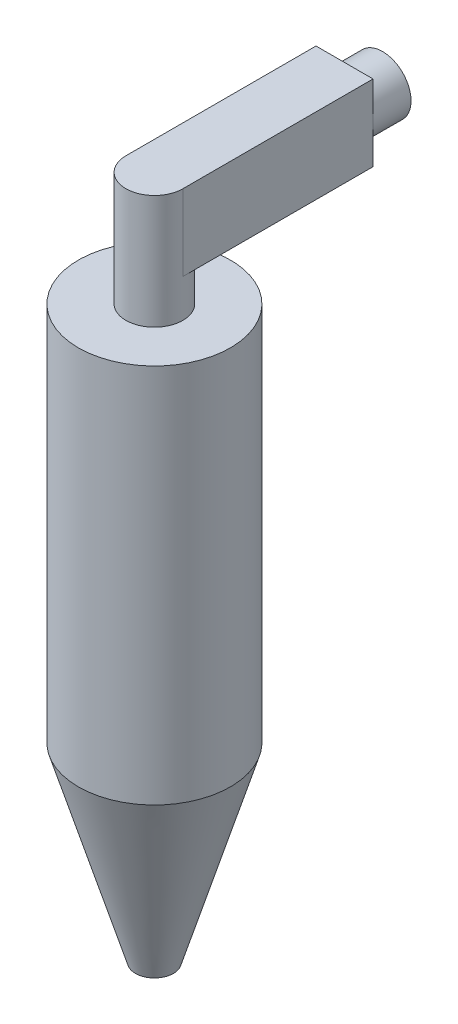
ISO-10303-21;
HEADER;
FILE_DESCRIPTION(('STEP AP214'),'2;1');
FILE_NAME('part.step','',(''),(''),'','','');
FILE_SCHEMA(('AUTOMOTIVE_DESIGN { 1 0 10303 214 1 1 1 1 }'));
ENDSEC;
DATA;
#1=APPLICATION_CONTEXT('core data for automotive mechanical design processes');
#2=APPLICATION_PROTOCOL_DEFINITION('international standard','automotive_design',2000,#1);
#3=PRODUCT_CONTEXT('',#1,'mechanical');
#4=PRODUCT('Part','Part','',(#3));
#5=PRODUCT_RELATED_PRODUCT_CATEGORY('part','',(#4));
#6=PRODUCT_DEFINITION_FORMATION('','',#4);
#7=PRODUCT_DEFINITION_CONTEXT('part definition',#1,'design');
#8=PRODUCT_DEFINITION('design','',#6,#7);
#9=PRODUCT_DEFINITION_SHAPE('','',#8);
#10=(LENGTH_UNIT() NAMED_UNIT(*) SI_UNIT(.MILLI.,.METRE.));
#11=(NAMED_UNIT(*) PLANE_ANGLE_UNIT() SI_UNIT($,.RADIAN.));
#12=(NAMED_UNIT(*) SI_UNIT($,.STERADIAN.) SOLID_ANGLE_UNIT());
#13=UNCERTAINTY_MEASURE_WITH_UNIT(LENGTH_MEASURE(1.E-05),#10,'distance_accuracy_value','');
#14=(GEOMETRIC_REPRESENTATION_CONTEXT(3) GLOBAL_UNCERTAINTY_ASSIGNED_CONTEXT((#13)) GLOBAL_UNIT_ASSIGNED_CONTEXT((#10,
#11,#12)) REPRESENTATION_CONTEXT('',''));
#15=CARTESIAN_POINT('',(0.,0.,0.));
#16=DIRECTION('',(0.,0.,1.));
#17=DIRECTION('',(1.,0.,0.));
#18=AXIS2_PLACEMENT_3D('',#15,#16,#17);
#19=CARTESIAN_POINT('',(0.,0.,-50.));
#20=DIRECTION('',(0.,0.,1.));
#21=DIRECTION('',(1.,0.,0.));
#22=AXIS2_PLACEMENT_3D('',#19,#20,#21);
#23=PLANE('',#22);
#24=CARTESIAN_POINT('',(0.,170.,-50.));
#25=DIRECTION('',(0.,0.,-1.));
#26=DIRECTION('',(-1.,0.,0.));
#27=AXIS2_PLACEMENT_3D('',#24,#25,#26);
#28=CIRCLE('',#27,7.5);
#29=CARTESIAN_POINT('',(-7.5,170.,-50.));
#30=VERTEX_POINT('',#29);
#31=CARTESIAN_POINT('',(7.5,170.,-50.));
#32=VERTEX_POINT('',#31);
#33=EDGE_CURVE('E48',#30,#32,#28,.T.);
#34=ORIENTED_EDGE('',*,*,#33,.F.);
#35=DIRECTION('',(0.,-1.,0.));
#36=VECTOR('',#35,1.);
#37=CARTESIAN_POINT('',(-7.5,180.,-50.));
#38=LINE('',#37,#36);
#39=CARTESIAN_POINT('',(-7.5,180.,-50.));
#40=VERTEX_POINT('',#39);
#41=EDGE_CURVE('E87',#40,#30,#38,.T.);
#42=ORIENTED_EDGE('',*,*,#41,.F.);
#43=DIRECTION('',(-1.,0.,0.));
#44=VECTOR('',#43,1.);
#45=CARTESIAN_POINT('',(-7.5,180.,-50.));
#46=LINE('',#45,#44);
#47=CARTESIAN_POINT('',(7.5,180.,-50.));
#48=VERTEX_POINT('',#47);
#49=EDGE_CURVE('E293',#48,#40,#46,.T.);
#50=ORIENTED_EDGE('',*,*,#49,.F.);
#51=DIRECTION('',(0.,1.,0.));
#52=VECTOR('',#51,1.);
#53=CARTESIAN_POINT('',(7.5,180.,-50.));
#54=LINE('',#53,#52);
#55=EDGE_CURVE('E105',#32,#48,#54,.T.);
#56=ORIENTED_EDGE('',*,*,#55,.F.);
#57=EDGE_LOOP('',(#34,#42,#50,#56));
#58=FACE_BOUND('',#57,.T.);
#59=ADVANCED_FACE('F37',(#58),#23,.F.);
#60=CARTESIAN_POINT('',(0.,0.,0.));
#61=DIRECTION('',(0.,1.,0.));
#62=DIRECTION('',(0.,0.,1.));
#63=AXIS2_PLACEMENT_3D('',#60,#61,#62);
#64=PLANE('',#63);
#65=CARTESIAN_POINT('',(0.,0.,0.));
#66=DIRECTION('',(0.,1.,0.));
#67=DIRECTION('',(0.,0.,1.));
#68=AXIS2_PLACEMENT_3D('',#65,#66,#67);
#69=CIRCLE('',#68,5.);
#70=CARTESIAN_POINT('',(0.,0.,5.));
#71=VERTEX_POINT('',#70);
#72=EDGE_CURVE('E168',#71,#71,#69,.T.);
#73=ORIENTED_EDGE('',*,*,#72,.F.);
#74=EDGE_LOOP('',(#73));
#75=FACE_BOUND('',#74,.T.);
#76=ADVANCED_FACE('F39',(#75),#64,.F.);
#77=CARTESIAN_POINT('',(0.,0.,0.));
#78=DIRECTION('',(0.,1.,0.));
#79=DIRECTION('',(0.,0.,1.));
#80=AXIS2_PLACEMENT_3D('',#77,#78,#79);
#81=CONICAL_SURFACE('',#80,5.,0.291456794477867);
#82=CARTESIAN_POINT('',(0.,50.,0.));
#83=DIRECTION('',(0.,1.,0.));
#84=DIRECTION('',(0.,0.,1.));
#85=AXIS2_PLACEMENT_3D('',#82,#83,#84);
#86=CIRCLE('',#85,20.);
#87=CARTESIAN_POINT('',(0.,50.,20.));
#88=VERTEX_POINT('',#87);
#89=EDGE_CURVE('E161',#88,#88,#86,.T.);
#90=CARTESIAN_POINT('',(0.,50.,20.));
#91=CARTESIAN_POINT('',(0.,49.4791666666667,19.84375));
#92=CARTESIAN_POINT('',(0.,48.9583333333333,19.6875));
#93=CARTESIAN_POINT('',(0.,47.9166666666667,19.375));
#94=CARTESIAN_POINT('',(0.,47.3958333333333,19.21875));
#95=CARTESIAN_POINT('',(0.,46.3541666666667,18.90625));
#96=CARTESIAN_POINT('',(0.,45.8333333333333,18.75));
#97=CARTESIAN_POINT('',(0.,44.7916666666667,18.4375));
#98=CARTESIAN_POINT('',(0.,44.2708333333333,18.28125));
#99=CARTESIAN_POINT('',(0.,43.2291666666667,17.96875));
#100=CARTESIAN_POINT('',(0.,42.7083333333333,17.8125));
#101=CARTESIAN_POINT('',(0.,41.6666666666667,17.5));
#102=CARTESIAN_POINT('',(0.,41.1458333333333,17.34375));
#103=CARTESIAN_POINT('',(0.,40.1041666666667,17.03125));
#104=CARTESIAN_POINT('',(0.,39.5833333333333,16.875));
#105=CARTESIAN_POINT('',(0.,38.5416666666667,16.5625));
#106=CARTESIAN_POINT('',(0.,38.0208333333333,16.40625));
#107=CARTESIAN_POINT('',(0.,36.9791666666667,16.09375));
#108=CARTESIAN_POINT('',(0.,36.4583333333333,15.9375));
#109=CARTESIAN_POINT('',(0.,35.4166666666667,15.625));
#110=CARTESIAN_POINT('',(0.,34.8958333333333,15.46875));
#111=CARTESIAN_POINT('',(0.,33.8541666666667,15.15625));
#112=CARTESIAN_POINT('',(0.,33.3333333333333,15.));
#113=CARTESIAN_POINT('',(0.,32.2916666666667,14.6875));
#114=CARTESIAN_POINT('',(0.,31.7708333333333,14.53125));
#115=CARTESIAN_POINT('',(0.,30.7291666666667,14.21875));
#116=CARTESIAN_POINT('',(0.,30.2083333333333,14.0625));
#117=CARTESIAN_POINT('',(0.,29.1666666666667,13.75));
#118=CARTESIAN_POINT('',(0.,28.6458333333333,13.59375));
#119=CARTESIAN_POINT('',(0.,27.6041666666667,13.28125));
#120=CARTESIAN_POINT('',(0.,27.0833333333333,13.125));
#121=CARTESIAN_POINT('',(0.,26.0416666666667,12.8125));
#122=CARTESIAN_POINT('',(0.,25.5208333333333,12.65625));
#123=CARTESIAN_POINT('',(0.,24.4791666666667,12.34375));
#124=CARTESIAN_POINT('',(0.,23.9583333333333,12.1875));
#125=CARTESIAN_POINT('',(0.,22.9166666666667,11.875));
#126=CARTESIAN_POINT('',(0.,22.3958333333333,11.71875));
#127=CARTESIAN_POINT('',(0.,21.3541666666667,11.40625));
#128=CARTESIAN_POINT('',(0.,20.8333333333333,11.25));
#129=CARTESIAN_POINT('',(0.,19.7916666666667,10.9375));
#130=CARTESIAN_POINT('',(0.,19.2708333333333,10.78125));
#131=CARTESIAN_POINT('',(0.,18.2291666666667,10.46875));
#132=CARTESIAN_POINT('',(0.,17.7083333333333,10.3125));
#133=CARTESIAN_POINT('',(0.,16.6666666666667,10.));
#134=CARTESIAN_POINT('',(0.,16.1458333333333,9.84375));
#135=CARTESIAN_POINT('',(0.,15.1041666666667,9.53125));
#136=CARTESIAN_POINT('',(0.,14.5833333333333,9.375));
#137=CARTESIAN_POINT('',(0.,13.5416666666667,9.0625));
#138=CARTESIAN_POINT('',(0.,13.0208333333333,8.90625));
#139=CARTESIAN_POINT('',(0.,11.9791666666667,8.59375));
#140=CARTESIAN_POINT('',(0.,11.4583333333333,8.4375));
#141=CARTESIAN_POINT('',(0.,10.4166666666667,8.125));
#142=CARTESIAN_POINT('',(0.,9.89583333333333,7.96875));
#143=CARTESIAN_POINT('',(0.,8.85416666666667,7.65625));
#144=CARTESIAN_POINT('',(0.,8.33333333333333,7.5));
#145=CARTESIAN_POINT('',(0.,7.29166666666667,7.1875));
#146=CARTESIAN_POINT('',(0.,6.77083333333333,7.03125));
#147=CARTESIAN_POINT('',(0.,5.72916666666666,6.71875));
#148=CARTESIAN_POINT('',(0.,5.20833333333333,6.5625));
#149=CARTESIAN_POINT('',(0.,4.16666666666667,6.25));
#150=CARTESIAN_POINT('',(0.,3.64583333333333,6.09375));
#151=CARTESIAN_POINT('',(0.,2.60416666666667,5.78125));
#152=CARTESIAN_POINT('',(0.,2.08333333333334,5.625));
#153=CARTESIAN_POINT('',(0.,1.04166666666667,5.3125));
#154=CARTESIAN_POINT('',(0.,0.520833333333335,5.15625));
#155=CARTESIAN_POINT('',(0.,0.,5.));
#156=B_SPLINE_CURVE_WITH_KNOTS('',3,(#90,#91,#92,#93,#94,#95,#96,#97,#98,#99,#100,#101,#102,
#103,#104,#105,#106,#107,#108,#109,#110,#111,#112,#113,#114,#115,#116,#117,#118,#119,#120,#121,
#122,#123,#124,#125,#126,#127,#128,#129,#130,#131,#132,#133,#134,#135,#136,#137,#138,#139,#140,
#141,#142,#143,#144,#145,#146,#147,#148,#149,#150,#151,#152,#153,#154,#155),.UNSPECIFIED.,.F.,
.F.,(4,2,2,2,2,2,2,2,2,2,2,2,2,2,2,2,2,2,2,2,2,2,2,2,2,2,2,2,2,2,2,2,4),(0.,1.63129789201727,
3.26259578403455,4.89389367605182,6.52519156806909,8.15648946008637,9.78778735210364,
11.4190852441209,13.0503831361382,14.6816810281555,16.3129789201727,17.94427681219,
19.5755747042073,21.2068725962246,22.8381704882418,24.4694683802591,26.1007662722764,
27.7320641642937,29.3633620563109,30.9946599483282,32.6259578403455,34.2572557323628,
35.88855362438,37.5198515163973,39.1511494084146,40.7824473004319,42.4137451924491,
44.0450430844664,45.6763409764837,47.307638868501,48.9389367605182,50.5702346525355,
52.2015325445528),.UNSPECIFIED.);
#157=EDGE_CURVE('BSEAM127',#88,#71,#156,.T.);
#158=ORIENTED_EDGE('',*,*,#89,.F.);
#159=ORIENTED_EDGE('',*,*,#72,.T.);
#160=ORIENTED_EDGE('',*,*,#157,.T.);
#161=ORIENTED_EDGE('',*,*,#157,.F.);
#162=EDGE_LOOP('',(#158,#160,#159,#161));
#163=FACE_BOUND('',#162,.T.);
#164=ADVANCED_FACE('F127',(#163),#81,.T.);
#165=CARTESIAN_POINT('',(0.,150.,0.));
#166=DIRECTION('',(0.,-1.,0.));
#167=DIRECTION('',(0.,0.,-1.));
#168=AXIS2_PLACEMENT_3D('',#165,#166,#167);
#169=CYLINDRICAL_SURFACE('',#168,20.);
#170=CARTESIAN_POINT('',(0.,150.,0.));
#171=DIRECTION('',(0.,1.,0.));
#172=DIRECTION('',(0.,0.,1.));
#173=AXIS2_PLACEMENT_3D('',#170,#171,#172);
#174=CIRCLE('',#173,20.);
#175=CARTESIAN_POINT('',(0.,150.,20.));
#176=VERTEX_POINT('',#175);
#177=EDGE_CURVE('E186',#176,#176,#174,.T.);
#178=ORIENTED_EDGE('',*,*,#177,.F.);
#179=EDGE_LOOP('',(#178));
#180=FACE_BOUND('',#179,.T.);
#181=ORIENTED_EDGE('',*,*,#89,.T.);
#182=EDGE_LOOP('',(#181));
#183=FACE_BOUND('',#182,.T.);
#184=ADVANCED_FACE('F149',(#180,#183),#169,.T.);
#185=CARTESIAN_POINT('',(0.,150.,0.));
#186=DIRECTION('',(0.,1.,0.));
#187=DIRECTION('',(0.,0.,1.));
#188=AXIS2_PLACEMENT_3D('',#185,#186,#187);
#189=PLANE('',#188);
#190=CARTESIAN_POINT('',(0.,150.,0.));
#191=DIRECTION('',(0.,1.,0.));
#192=DIRECTION('',(0.,0.,1.));
#193=AXIS2_PLACEMENT_3D('',#190,#191,#192);
#194=CIRCLE('',#193,7.5);
#195=CARTESIAN_POINT('',(0.,150.,7.5));
#196=VERTEX_POINT('',#195);
#197=EDGE_CURVE('E195',#196,#196,#194,.T.);
#198=ORIENTED_EDGE('',*,*,#197,.F.);
#199=EDGE_LOOP('',(#198));
#200=FACE_BOUND('',#199,.T.);
#201=ORIENTED_EDGE('',*,*,#177,.T.);
#202=EDGE_LOOP('',(#201));
#203=FACE_BOUND('',#202,.T.);
#204=ADVANCED_FACE('F145',(#200,#203),#189,.T.);
#205=CARTESIAN_POINT('',(0.,180.,0.));
#206=DIRECTION('',(0.,-1.,0.));
#207=DIRECTION('',(0.,0.,-1.));
#208=AXIS2_PLACEMENT_3D('',#205,#206,#207);
#209=CYLINDRICAL_SURFACE('',#208,7.5);
#210=CARTESIAN_POINT('',(0.,180.,0.));
#211=DIRECTION('',(0.,1.,0.));
#212=DIRECTION('',(0.,0.,1.));
#213=AXIS2_PLACEMENT_3D('',#210,#211,#212);
#214=CIRCLE('',#213,7.5);
#215=CARTESIAN_POINT('',(-7.5,180.,0.));
#216=VERTEX_POINT('',#215);
#217=CARTESIAN_POINT('',(7.5,180.,0.));
#218=VERTEX_POINT('',#217);
#219=EDGE_CURVE('E190',#216,#218,#214,.T.);
#220=ORIENTED_EDGE('',*,*,#219,.F.);
#221=DIRECTION('',(0.,-1.,0.));
#222=VECTOR('',#221,1.);
#223=CARTESIAN_POINT('',(-7.5,180.,0.));
#224=LINE('',#223,#222);
#225=CARTESIAN_POINT('',(-7.5,160.,0.));
#226=VERTEX_POINT('',#225);
#227=EDGE_CURVE('E298',#216,#226,#224,.T.);
#228=ORIENTED_EDGE('',*,*,#227,.T.);
#229=CARTESIAN_POINT('',(0.,160.,0.));
#230=DIRECTION('',(0.,-1.,0.));
#231=DIRECTION('',(0.,0.,-1.));
#232=AXIS2_PLACEMENT_3D('',#229,#230,#231);
#233=CIRCLE('',#232,7.5);
#234=CARTESIAN_POINT('',(7.5,160.,0.));
#235=VERTEX_POINT('',#234);
#236=EDGE_CURVE('E42',#226,#235,#233,.T.);
#237=ORIENTED_EDGE('',*,*,#236,.T.);
#238=DIRECTION('',(0.,1.,0.));
#239=VECTOR('',#238,1.);
#240=CARTESIAN_POINT('',(7.5,180.,0.));
#241=LINE('',#240,#239);
#242=EDGE_CURVE('E103',#235,#218,#241,.T.);
#243=ORIENTED_EDGE('',*,*,#242,.T.);
#244=EDGE_LOOP('',(#220,#228,#237,#243));
#245=FACE_BOUND('',#244,.T.);
#246=ORIENTED_EDGE('',*,*,#197,.T.);
#247=EDGE_LOOP('',(#246));
#248=FACE_BOUND('',#247,.T.);
#249=ADVANCED_FACE('F141',(#245,#248),#209,.T.);
#250=CARTESIAN_POINT('',(0.,180.,0.));
#251=DIRECTION('',(0.,1.,0.));
#252=DIRECTION('',(0.,0.,1.));
#253=AXIS2_PLACEMENT_3D('',#250,#251,#252);
#254=PLANE('',#253);
#255=ORIENTED_EDGE('',*,*,#219,.T.);
#256=DIRECTION('',(0.,0.,1.));
#257=VECTOR('',#256,1.);
#258=CARTESIAN_POINT('',(7.5,180.,-50.));
#259=LINE('',#258,#257);
#260=EDGE_CURVE('E61',#48,#218,#259,.T.);
#261=ORIENTED_EDGE('',*,*,#260,.F.);
#262=ORIENTED_EDGE('',*,*,#49,.T.);
#263=DIRECTION('',(0.,0.,1.));
#264=VECTOR('',#263,1.);
#265=CARTESIAN_POINT('',(-7.5,180.,-50.));
#266=LINE('',#265,#264);
#267=EDGE_CURVE('E93',#40,#216,#266,.T.);
#268=ORIENTED_EDGE('',*,*,#267,.T.);
#269=EDGE_LOOP('',(#255,#261,#262,#268));
#270=FACE_BOUND('',#269,.T.);
#271=ADVANCED_FACE('F138',(#270),#254,.T.);
#272=CARTESIAN_POINT('',(-7.5,180.,-50.));
#273=DIRECTION('',(-1.,0.,0.));
#274=DIRECTION('',(0.,-1.,0.));
#275=AXIS2_PLACEMENT_3D('',#272,#273,#274);
#276=PLANE('',#275);
#277=ORIENTED_EDGE('',*,*,#227,.F.);
#278=ORIENTED_EDGE('',*,*,#267,.F.);
#279=ORIENTED_EDGE('',*,*,#41,.T.);
#280=CARTESIAN_POINT('',(-7.5,160.,-50.));
#281=VERTEX_POINT('',#280);
#282=EDGE_CURVE('E91',#30,#281,#38,.T.);
#283=ORIENTED_EDGE('',*,*,#282,.T.);
#284=DIRECTION('',(0.,0.,1.));
#285=VECTOR('',#284,1.);
#286=CARTESIAN_POINT('',(-7.5,160.,-50.));
#287=LINE('',#286,#285);
#288=EDGE_CURVE('E290',#281,#226,#287,.T.);
#289=ORIENTED_EDGE('',*,*,#288,.T.);
#290=EDGE_LOOP('',(#277,#278,#279,#283,#289));
#291=FACE_BOUND('',#290,.T.);
#292=ADVANCED_FACE('F89',(#291),#276,.T.);
#293=CARTESIAN_POINT('',(7.5,180.,-50.));
#294=DIRECTION('',(1.,0.,0.));
#295=DIRECTION('',(0.,1.,0.));
#296=AXIS2_PLACEMENT_3D('',#293,#294,#295);
#297=PLANE('',#296);
#298=ORIENTED_EDGE('',*,*,#242,.F.);
#299=DIRECTION('',(0.,0.,1.));
#300=VECTOR('',#299,1.);
#301=CARTESIAN_POINT('',(7.5,160.,-50.));
#302=LINE('',#301,#300);
#303=CARTESIAN_POINT('',(7.5,160.,-50.));
#304=VERTEX_POINT('',#303);
#305=EDGE_CURVE('E292',#304,#235,#302,.T.);
#306=ORIENTED_EDGE('',*,*,#305,.F.);
#307=EDGE_CURVE('E302',#304,#32,#54,.T.);
#308=ORIENTED_EDGE('',*,*,#307,.T.);
#309=ORIENTED_EDGE('',*,*,#55,.T.);
#310=ORIENTED_EDGE('',*,*,#260,.T.);
#311=EDGE_LOOP('',(#298,#306,#308,#309,#310));
#312=FACE_BOUND('',#311,.T.);
#313=ADVANCED_FACE('F130',(#312),#297,.T.);
#314=CARTESIAN_POINT('',(-7.5,160.,-50.));
#315=DIRECTION('',(0.,-1.,0.));
#316=DIRECTION('',(0.,0.,-1.));
#317=AXIS2_PLACEMENT_3D('',#314,#315,#316);
#318=PLANE('',#317);
#319=ORIENTED_EDGE('',*,*,#236,.F.);
#320=ORIENTED_EDGE('',*,*,#288,.F.);
#321=DIRECTION('',(1.,0.,0.));
#322=VECTOR('',#321,1.);
#323=CARTESIAN_POINT('',(-7.5,160.,-50.));
#324=LINE('',#323,#322);
#325=EDGE_CURVE('E98',#281,#304,#324,.T.);
#326=ORIENTED_EDGE('',*,*,#325,.T.);
#327=ORIENTED_EDGE('',*,*,#305,.T.);
#328=EDGE_LOOP('',(#319,#320,#326,#327));
#329=FACE_BOUND('',#328,.T.);
#330=ADVANCED_FACE('F120',(#329),#318,.T.);
#331=EDGE_CURVE('E12',#32,#30,#28,.T.);
#332=ORIENTED_EDGE('',*,*,#331,.F.);
#333=ORIENTED_EDGE('',*,*,#307,.F.);
#334=ORIENTED_EDGE('',*,*,#325,.F.);
#335=ORIENTED_EDGE('',*,*,#282,.F.);
#336=EDGE_LOOP('',(#332,#333,#334,#335));
#337=FACE_BOUND('',#336,.T.);
#338=ADVANCED_FACE('F101',(#337),#23,.F.);
#339=CARTESIAN_POINT('',(0.,170.,-60.));
#340=DIRECTION('',(0.,0.,1.));
#341=DIRECTION('',(1.,0.,0.));
#342=AXIS2_PLACEMENT_3D('',#339,#340,#341);
#343=CYLINDRICAL_SURFACE('',#342,7.5);
#344=CARTESIAN_POINT('',(0.,170.,-60.));
#345=DIRECTION('',(0.,0.,-1.));
#346=DIRECTION('',(-1.,0.,0.));
#347=AXIS2_PLACEMENT_3D('',#344,#345,#346);
#348=CIRCLE('',#347,7.5);
#349=CARTESIAN_POINT('',(-7.5,170.,-60.));
#350=VERTEX_POINT('',#349);
#351=EDGE_CURVE('E108',#350,#350,#348,.T.);
#352=ORIENTED_EDGE('',*,*,#351,.F.);
#353=EDGE_LOOP('',(#352));
#354=FACE_BOUND('',#353,.T.);
#355=ORIENTED_EDGE('',*,*,#33,.T.);
#356=ORIENTED_EDGE('',*,*,#331,.T.);
#357=EDGE_LOOP('',(#355,#356));
#358=FACE_BOUND('',#357,.T.);
#359=ADVANCED_FACE('F109',(#354,#358),#343,.T.);
#360=CARTESIAN_POINT('',(0.,170.,-60.));
#361=DIRECTION('',(0.,0.,-1.));
#362=DIRECTION('',(-1.,0.,0.));
#363=AXIS2_PLACEMENT_3D('',#360,#361,#362);
#364=PLANE('',#363);
#365=ORIENTED_EDGE('',*,*,#351,.T.);
#366=EDGE_LOOP('',(#365));
#367=FACE_BOUND('',#366,.T.);
#368=ADVANCED_FACE('F111',(#367),#364,.T.);
#369=CLOSED_SHELL('',(#59,#76,#164,#184,#204,#249,#271,#292,#313,#330,#338,#359,#368));
#370=MANIFOLD_SOLID_BREP('B2',#369);
#371=ADVANCED_BREP_SHAPE_REPRESENTATION('',(#18,#370),#14);
#372=SHAPE_DEFINITION_REPRESENTATION(#9,#371);
ENDSEC;
END-ISO-10303-21;
